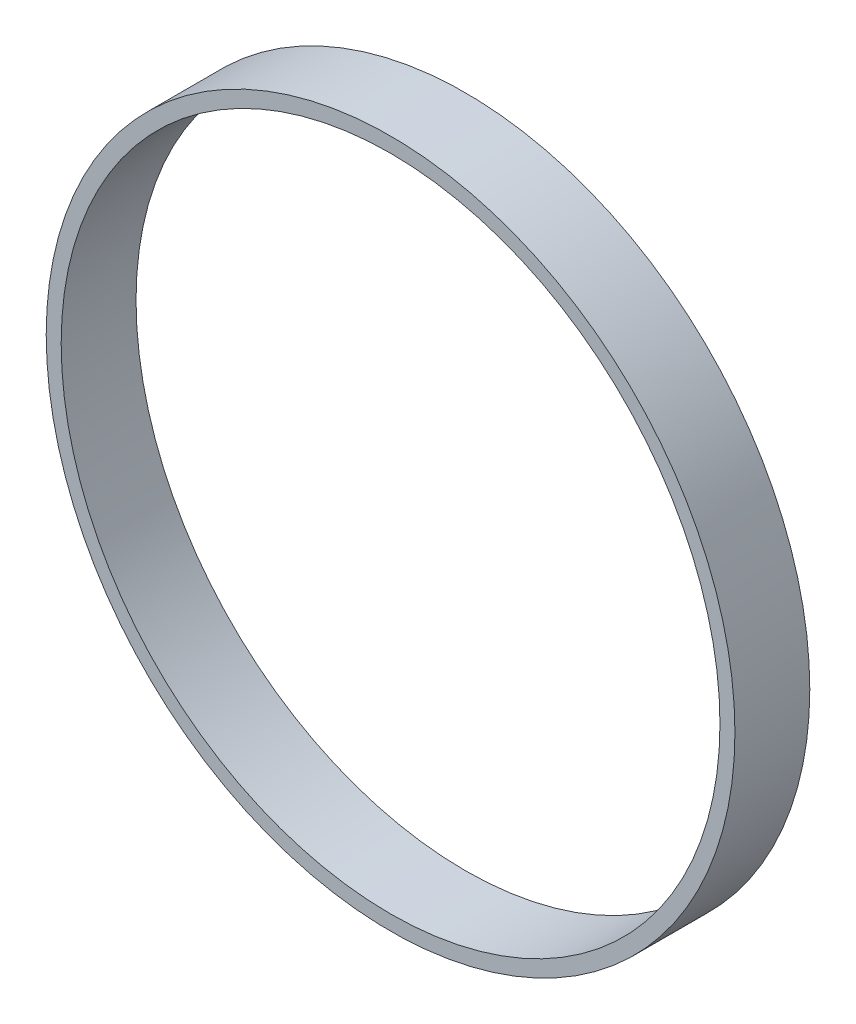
from build123d import *

# Parameters (mm, degrees)
ESQUISSE1_R      = 23
ESQUISSE1_R_2    = 22
EXTRUSION1_DEPTH = 5


with BuildPart() as part:
    # Esquisse1 → Extrusion1 (new body)
    with BuildSketch(Plane.XY):
        Circle(ESQUISSE1_R)
        Circle(ESQUISSE1_R_2, mode=Mode.SUBTRACT)
    extrude(amount=EXTRUSION1_DEPTH)


solid = part.part
